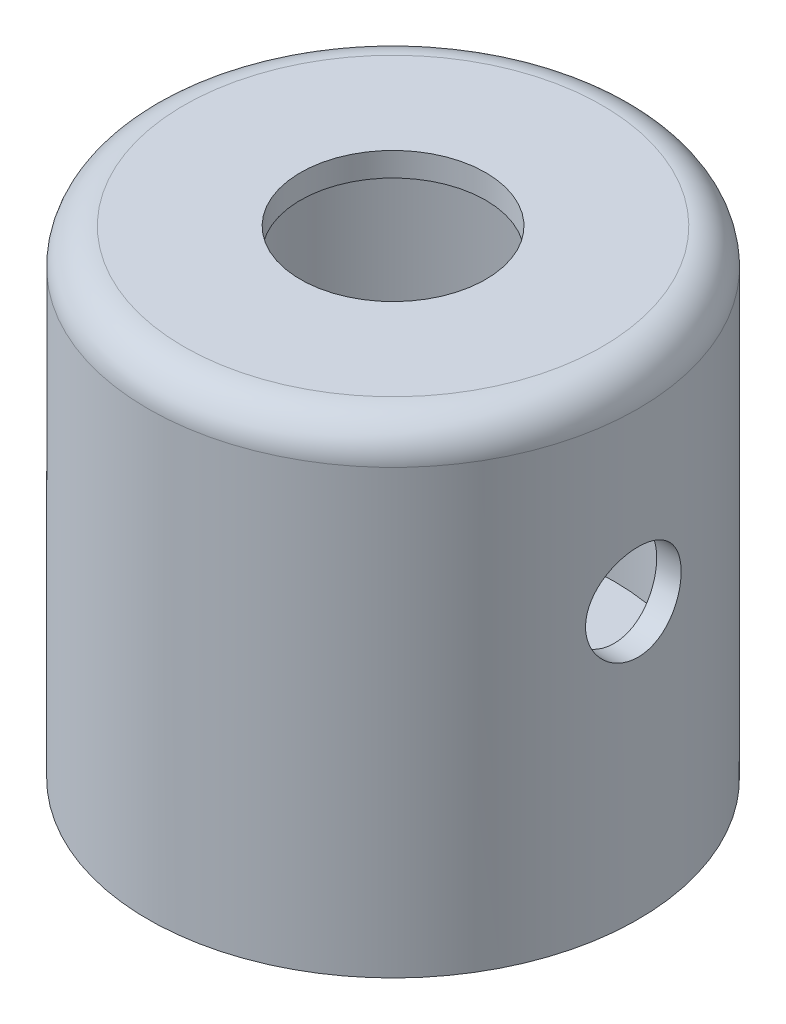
ISO-10303-21;
HEADER;
FILE_DESCRIPTION(('STEP AP214'),'2;1');
FILE_NAME('part.step','',(''),(''),'','','');
FILE_SCHEMA(('AUTOMOTIVE_DESIGN { 1 0 10303 214 1 1 1 1 }'));
ENDSEC;
DATA;
#1=APPLICATION_CONTEXT('core data for automotive mechanical design processes');
#2=APPLICATION_PROTOCOL_DEFINITION('international standard','automotive_design',2000,#1);
#3=PRODUCT_CONTEXT('',#1,'mechanical');
#4=PRODUCT('Part','Part','',(#3));
#5=PRODUCT_RELATED_PRODUCT_CATEGORY('part','',(#4));
#6=PRODUCT_DEFINITION_FORMATION('','',#4);
#7=PRODUCT_DEFINITION_CONTEXT('part definition',#1,'design');
#8=PRODUCT_DEFINITION('design','',#6,#7);
#9=PRODUCT_DEFINITION_SHAPE('','',#8);
#10=(LENGTH_UNIT() NAMED_UNIT(*) SI_UNIT(.MILLI.,.METRE.));
#11=(NAMED_UNIT(*) PLANE_ANGLE_UNIT() SI_UNIT($,.RADIAN.));
#12=(NAMED_UNIT(*) SI_UNIT($,.STERADIAN.) SOLID_ANGLE_UNIT());
#13=UNCERTAINTY_MEASURE_WITH_UNIT(LENGTH_MEASURE(1.E-05),#10,'distance_accuracy_value','');
#14=(GEOMETRIC_REPRESENTATION_CONTEXT(3) GLOBAL_UNCERTAINTY_ASSIGNED_CONTEXT((#13)) GLOBAL_UNIT_ASSIGNED_CONTEXT((#10,
#11,#12)) REPRESENTATION_CONTEXT('',''));
#15=CARTESIAN_POINT('',(0.,0.,0.));
#16=DIRECTION('',(0.,0.,1.));
#17=DIRECTION('',(1.,0.,0.));
#18=AXIS2_PLACEMENT_3D('',#15,#16,#17);
#19=CARTESIAN_POINT('',(0.,-16.6647208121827,0.));
#20=DIRECTION('',(0.,-1.,0.));
#21=DIRECTION('',(0.,0.,-1.));
#22=AXIS2_PLACEMENT_3D('',#19,#20,#21);
#23=CYLINDRICAL_SURFACE('',#22,20.5);
#24=CARTESIAN_POINT('',(0.,0.,0.));
#25=DIRECTION('',(0.,-1.,0.));
#26=DIRECTION('',(0.,0.,-1.));
#27=AXIS2_PLACEMENT_3D('',#24,#25,#26);
#28=CIRCLE('',#27,20.5);
#29=CARTESIAN_POINT('',(0.,0.,-20.5));
#30=VERTEX_POINT('',#29);
#31=EDGE_CURVE('E51',#30,#30,#28,.T.);
#32=ORIENTED_EDGE('',*,*,#31,.F.);
#33=EDGE_LOOP('',(#32));
#34=FACE_BOUND('',#33,.T.);
#35=CARTESIAN_POINT('',(0.,37.,0.));
#36=DIRECTION('',(0.,1.,0.));
#37=DIRECTION('',(0.,0.,1.));
#38=AXIS2_PLACEMENT_3D('',#35,#36,#37);
#39=CIRCLE('',#38,20.5);
#40=CARTESIAN_POINT('',(0.,37.,20.5));
#41=VERTEX_POINT('',#40);
#42=EDGE_CURVE('E48',#41,#41,#39,.F.);
#43=ORIENTED_EDGE('',*,*,#42,.T.);
#44=EDGE_LOOP('',(#43));
#45=FACE_BOUND('',#44,.T.);
#46=CARTESIAN_POINT('',(20.1059692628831,23.,4.));
#47=CARTESIAN_POINT('',(20.1059736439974,23.222374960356,3.9999916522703));
#48=CARTESIAN_POINT('',(20.1096986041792,23.4448563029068,3.9813930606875));
#49=CARTESIAN_POINT('',(20.1241754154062,23.8835332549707,3.90754738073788));
#50=CARTESIAN_POINT('',(20.1349330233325,24.0997235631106,3.85227026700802));
#51=CARTESIAN_POINT('',(20.1622114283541,24.519408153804,3.70684007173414));
#52=CARTESIAN_POINT('',(20.1787266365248,24.7229145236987,3.61672080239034));
#53=CARTESIAN_POINT('',(20.2156527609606,25.1119110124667,3.40425584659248));
#54=CARTESIAN_POINT('',(20.2360634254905,25.2974022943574,3.28191224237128));
#55=CARTESIAN_POINT('',(20.2787877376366,25.6476123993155,3.00671532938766));
#56=CARTESIAN_POINT('',(20.301121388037,25.8120533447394,2.85351144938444));
#57=CARTESIAN_POINT('',(20.3449989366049,26.1130709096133,2.52170041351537));
#58=CARTESIAN_POINT('',(20.3665427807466,26.249645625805,2.34309152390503));
#59=CARTESIAN_POINT('',(20.4066284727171,26.4921268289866,1.96370629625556));
#60=CARTESIAN_POINT('',(20.4251439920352,26.597770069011,1.76275868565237));
#61=CARTESIAN_POINT('',(20.4568624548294,26.7736918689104,1.34554453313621));
#62=CARTESIAN_POINT('',(20.4700658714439,26.8439735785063,1.12927935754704));
#63=CARTESIAN_POINT('',(20.4895311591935,26.946314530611,0.69045119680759));
#64=CARTESIAN_POINT('',(20.4958781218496,26.9788426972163,0.468001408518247));
#65=CARTESIAN_POINT('',(20.5012090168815,27.0062154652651,0.0207174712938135));
#66=CARTESIAN_POINT('',(20.5001936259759,27.0010635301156,-0.204116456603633));
#67=CARTESIAN_POINT('',(20.4909803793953,26.9535795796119,-0.646566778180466));
#68=CARTESIAN_POINT('',(20.4828800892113,26.9117525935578,-0.864239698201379));
#69=CARTESIAN_POINT('',(20.4605169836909,26.7929059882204,-1.28941675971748));
#70=CARTESIAN_POINT('',(20.4462539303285,26.7158850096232,-1.49692050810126));
#71=CARTESIAN_POINT('',(20.4130061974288,26.5283636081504,-1.89731928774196));
#72=CARTESIAN_POINT('',(20.3939935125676,26.4176637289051,-2.09011848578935));
#73=CARTESIAN_POINT('',(20.3533451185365,26.1660742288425,-2.4545921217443));
#74=CARTESIAN_POINT('',(20.3317091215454,26.0251812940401,-2.6262642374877));
#75=CARTESIAN_POINT('',(20.2877828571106,25.7144295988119,-2.94660576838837));
#76=CARTESIAN_POINT('',(20.2654876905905,25.5441289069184,-3.09484612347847));
#77=CARTESIAN_POINT('',(20.2230975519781,25.1808615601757,-3.36073015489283));
#78=CARTESIAN_POINT('',(20.2030026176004,24.9878945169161,-3.47837330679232));
#79=CARTESIAN_POINT('',(20.1672795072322,24.5841747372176,-3.67986121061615));
#80=CARTESIAN_POINT('',(20.1516601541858,24.3733879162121,-3.76363933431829));
#81=CARTESIAN_POINT('',(20.1267882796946,23.9403554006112,-3.89446695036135));
#82=CARTESIAN_POINT('',(20.1175349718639,23.7181111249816,-3.94152097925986));
#83=CARTESIAN_POINT('',(20.1065996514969,23.27235331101,-3.99692935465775));
#84=CARTESIAN_POINT('',(20.1047966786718,23.0489195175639,-4.00590203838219));
#85=CARTESIAN_POINT('',(20.1086418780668,22.6037472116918,-3.9865543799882));
#86=CARTESIAN_POINT('',(20.1142896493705,22.3820086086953,-3.95823604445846));
#87=CARTESIAN_POINT('',(20.1322869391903,21.9485812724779,-3.86564238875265));
#88=CARTESIAN_POINT('',(20.144575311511,21.7368197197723,-3.80169497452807));
#89=CARTESIAN_POINT('',(20.1744159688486,21.3270164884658,-3.64000793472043));
#90=CARTESIAN_POINT('',(20.1919686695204,21.1289758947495,-3.54226564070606));
#91=CARTESIAN_POINT('',(20.2306334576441,20.7495232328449,-3.31435437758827));
#92=CARTESIAN_POINT('',(20.2517871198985,20.5683487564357,-3.18379702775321));
#93=CARTESIAN_POINT('',(20.2951551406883,20.2302546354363,-2.89448178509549));
#94=CARTESIAN_POINT('',(20.3173696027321,20.0733373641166,-2.73572113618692));
#95=CARTESIAN_POINT('',(20.3607472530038,19.7858812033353,-2.39173570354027));
#96=CARTESIAN_POINT('',(20.3818904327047,19.6557595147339,-2.2061593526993));
#97=CARTESIAN_POINT('',(20.4203998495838,19.4285415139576,-1.81542090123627));
#98=CARTESIAN_POINT('',(20.4377662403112,19.3314438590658,-1.61025959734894));
#99=CARTESIAN_POINT('',(20.4666796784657,19.1736448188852,-1.18729396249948));
#100=CARTESIAN_POINT('',(20.4782585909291,19.11274378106,-0.969566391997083));
#101=CARTESIAN_POINT('',(20.4944288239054,19.0284322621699,-0.526724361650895));
#102=CARTESIAN_POINT('',(20.4990209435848,19.0050174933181,-0.301610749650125));
#103=CARTESIAN_POINT('',(20.5006824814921,18.9965025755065,0.14562193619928));
#104=CARTESIAN_POINT('',(20.4978752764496,19.0107740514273,0.367728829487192));
#105=CARTESIAN_POINT('',(20.4853117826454,19.0758435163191,0.80631481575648));
#106=CARTESIAN_POINT('',(20.4755555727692,19.1266410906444,1.02279397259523));
#107=CARTESIAN_POINT('',(20.4501923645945,19.2630471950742,1.44361146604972));
#108=CARTESIAN_POINT('',(20.4345974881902,19.3485836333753,1.64797394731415));
#109=CARTESIAN_POINT('',(20.3992396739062,19.5519616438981,2.03953776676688));
#110=CARTESIAN_POINT('',(20.3794764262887,19.669805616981,2.22673782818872));
#111=CARTESIAN_POINT('',(20.3375736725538,19.9365904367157,2.5817796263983));
#112=CARTESIAN_POINT('',(20.3154022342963,20.0859826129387,2.74927849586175));
#113=CARTESIAN_POINT('',(20.2713762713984,20.4106920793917,3.05704655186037));
#114=CARTESIAN_POINT('',(20.2495218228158,20.5860154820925,3.19730930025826));
#115=CARTESIAN_POINT('',(20.208360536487,20.959745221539,3.44797155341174));
#116=CARTESIAN_POINT('',(20.1890818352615,21.1583679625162,3.55805320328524));
#117=CARTESIAN_POINT('',(20.1555964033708,21.5716071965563,3.74310681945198));
#118=CARTESIAN_POINT('',(20.1413850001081,21.7862087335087,3.8181111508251));
#119=CARTESIAN_POINT('',(20.1225305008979,22.1677965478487,3.91605787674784));
#120=CARTESIAN_POINT('',(20.1163578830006,22.3325828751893,3.94748080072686));
#121=CARTESIAN_POINT('',(20.1080756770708,22.6648927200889,3.98945467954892));
#122=CARTESIAN_POINT('',(20.1059659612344,22.8324161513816,4.00000629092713));
#123=CARTESIAN_POINT('',(20.1059692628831,23.,4.));
#124=B_SPLINE_CURVE_WITH_KNOTS('',3,(#46,#47,#48,#49,#50,#51,#52,#53,#54,#55,#56,#57,#58,#59,
#60,#61,#62,#63,#64,#65,#66,#67,#68,#69,#70,#71,#72,#73,#74,#75,#76,#77,#78,#79,#80,#81,#82,#83,
#84,#85,#86,#87,#88,#89,#90,#91,#92,#93,#94,#95,#96,#97,#98,#99,#100,#101,#102,#103,#104,#105,
#106,#107,#108,#109,#110,#111,#112,#113,#114,#115,#116,#117,#118,#119,#120,#121,#122,#123),
.UNSPECIFIED.,.T.,.F.,(4,2,2,2,2,2,2,2,2,2,2,2,2,2,2,2,2,2,2,2,2,2,2,2,2,2,2,2,2,2,2,2,2,2,2,2,
2,2,4),(0.,0.666511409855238,1.3335691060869,1.99998108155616,2.66635000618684,3.34076545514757,
4.0152269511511,4.69527197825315,5.37525642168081,6.04670143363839,6.71808472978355,
7.38036550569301,8.04267186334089,8.70897957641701,9.37536046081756,10.0528011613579,
10.7302534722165,11.4090322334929,12.087727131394,12.7553586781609,13.4229543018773,
14.0845049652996,14.7461078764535,15.4159437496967,16.0858451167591,16.7654973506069,
17.4451219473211,18.1209622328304,18.7967252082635,19.4612920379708,20.1258513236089,
20.7890384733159,21.4522749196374,22.1257345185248,22.7993531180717,23.4798149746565,
24.1596477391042,24.6619527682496,25.1642419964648),.UNSPECIFIED.);
#125=CARTESIAN_POINT('',(20.1059692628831,23.,4.));
#126=VERTEX_POINT('',#125);
#127=EDGE_CURVE('E75',#126,#126,#124,.T.);
#128=ORIENTED_EDGE('',*,*,#127,.T.);
#129=EDGE_LOOP('',(#128));
#130=FACE_BOUND('',#129,.T.);
#131=ADVANCED_FACE('F27',(#34,#45,#130),#23,.T.);
#132=CARTESIAN_POINT('',(0.,-16.6647208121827,0.));
#133=DIRECTION('',(0.,-1.,0.));
#134=DIRECTION('',(0.,0.,-1.));
#135=AXIS2_PLACEMENT_3D('',#132,#133,#134);
#136=CYLINDRICAL_SURFACE('',#135,18.5);
#137=CARTESIAN_POINT('',(0.,5.,0.));
#138=DIRECTION('',(0.,-1.,0.));
#139=DIRECTION('',(0.,0.,-1.));
#140=AXIS2_PLACEMENT_3D('',#137,#138,#139);
#141=CIRCLE('',#140,18.5);
#142=CARTESIAN_POINT('',(0.,5.,-18.5));
#143=VERTEX_POINT('',#142);
#144=EDGE_CURVE('E60',#143,#143,#141,.T.);
#145=ORIENTED_EDGE('',*,*,#144,.T.);
#146=EDGE_LOOP('',(#145));
#147=FACE_BOUND('',#146,.T.);
#148=CARTESIAN_POINT('',(0.,37.,0.));
#149=DIRECTION('',(0.,-1.,0.));
#150=DIRECTION('',(0.,0.,-1.));
#151=AXIS2_PLACEMENT_3D('',#148,#149,#150);
#152=CIRCLE('',#151,18.5);
#153=CARTESIAN_POINT('',(0.,37.,-18.5));
#154=VERTEX_POINT('',#153);
#155=EDGE_CURVE('E10',#154,#154,#152,.F.);
#156=ORIENTED_EDGE('',*,*,#155,.T.);
#157=EDGE_LOOP('',(#156));
#158=FACE_BOUND('',#157,.T.);
#159=CARTESIAN_POINT('',(18.0623918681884,23.,4.));
#160=CARTESIAN_POINT('',(18.0623963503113,22.7781543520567,3.99999228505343));
#161=CARTESIAN_POINT('',(18.0665234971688,22.5562153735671,3.98148143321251));
#162=CARTESIAN_POINT('',(18.0825566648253,22.1186443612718,3.90800545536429));
#163=CARTESIAN_POINT('',(18.09446839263,21.9030170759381,3.85301358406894));
#164=CARTESIAN_POINT('',(18.1246600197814,21.4844625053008,3.70838424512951));
#165=CARTESIAN_POINT('',(18.1429330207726,21.2815217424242,3.61878429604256));
#166=CARTESIAN_POINT('',(18.1837799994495,20.8935496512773,3.40758896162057));
#167=CARTESIAN_POINT('',(18.2063538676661,20.708517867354,3.28599439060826));
#168=CARTESIAN_POINT('',(18.2536754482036,20.358557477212,3.01212159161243));
#169=CARTESIAN_POINT('',(18.2784504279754,20.1939675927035,2.85941517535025));
#170=CARTESIAN_POINT('',(18.3271438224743,19.8925283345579,2.5285779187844));
#171=CARTESIAN_POINT('',(18.3510621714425,19.7556810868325,2.35044513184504));
#172=CARTESIAN_POINT('',(18.3956439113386,19.5122753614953,1.9715445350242));
#173=CARTESIAN_POINT('',(18.4162713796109,19.4060421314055,1.7705631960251));
#174=CARTESIAN_POINT('',(18.4516394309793,19.2289834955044,1.35308090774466));
#175=CARTESIAN_POINT('',(18.4663806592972,19.1581542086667,1.13658166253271));
#176=CARTESIAN_POINT('',(18.488122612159,19.0549778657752,0.697730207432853));
#177=CARTESIAN_POINT('',(18.4952384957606,19.0220577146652,0.475518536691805));
#178=CARTESIAN_POINT('',(18.5013268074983,18.9938428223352,0.0286201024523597));
#179=CARTESIAN_POINT('',(18.5003001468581,18.9985438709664,-0.196066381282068));
#180=CARTESIAN_POINT('',(18.4903072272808,19.045010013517,-0.637587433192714));
#181=CARTESIAN_POINT('',(18.4814732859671,19.0861574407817,-0.854490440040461));
#182=CARTESIAN_POINT('',(18.4570089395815,19.2033646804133,-1.27823806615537));
#183=CARTESIAN_POINT('',(18.4413782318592,19.2794260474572,-1.48508223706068));
#184=CARTESIAN_POINT('',(18.4048631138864,19.4648519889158,-1.88456186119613));
#185=CARTESIAN_POINT('',(18.3839417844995,19.5744517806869,-2.07708462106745));
#186=CARTESIAN_POINT('',(18.3391411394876,19.8236682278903,-2.4412315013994));
#187=CARTESIAN_POINT('',(18.3152614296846,19.9632888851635,-2.6128528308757));
#188=CARTESIAN_POINT('',(18.2665983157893,20.2719500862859,-2.93399763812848));
#189=CARTESIAN_POINT('',(18.2418064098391,20.4415312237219,-3.08300069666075));
#190=CARTESIAN_POINT('',(18.1945688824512,20.8035298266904,-3.35054852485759));
#191=CARTESIAN_POINT('',(18.1721233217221,20.995947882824,-3.46909250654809));
#192=CARTESIAN_POINT('',(18.1320981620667,21.3989865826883,-3.6725811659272));
#193=CARTESIAN_POINT('',(18.114532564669,21.6096573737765,-3.75742945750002));
#194=CARTESIAN_POINT('',(18.0864516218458,22.0427361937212,-3.89036395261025));
#195=CARTESIAN_POINT('',(18.0759351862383,22.2651424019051,-3.9384558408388));
#196=CARTESIAN_POINT('',(18.0633650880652,22.7106288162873,-3.99570924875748));
#197=CARTESIAN_POINT('',(18.0611469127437,22.9336072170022,-4.00562767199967));
#198=CARTESIAN_POINT('',(18.0649810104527,23.378031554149,-3.98830010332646));
#199=CARTESIAN_POINT('',(18.0710327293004,23.5994775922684,-3.96105660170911));
#200=CARTESIAN_POINT('',(18.0905695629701,24.031928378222,-3.8708346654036));
#201=CARTESIAN_POINT('',(18.1039682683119,24.2430240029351,-3.80827138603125));
#202=CARTESIAN_POINT('',(18.1366117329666,24.6517365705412,-3.64963456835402));
#203=CARTESIAN_POINT('',(18.1558570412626,24.8493522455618,-3.55355788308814));
#204=CARTESIAN_POINT('',(18.1983878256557,25.2287759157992,-3.32894759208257));
#205=CARTESIAN_POINT('',(18.2217298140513,25.4103008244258,-3.19994669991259));
#206=CARTESIAN_POINT('',(18.2696740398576,25.7494041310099,-2.91376287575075));
#207=CARTESIAN_POINT('',(18.2942764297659,25.9069796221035,-2.75657652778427));
#208=CARTESIAN_POINT('',(18.3425105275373,26.1966395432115,-2.41506237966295));
#209=CARTESIAN_POINT('',(18.3661164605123,26.3282085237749,-2.23029314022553));
#210=CARTESIAN_POINT('',(18.4092273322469,26.5584387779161,-1.84083556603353));
#211=CARTESIAN_POINT('',(18.4287324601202,26.6571015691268,-1.63614815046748));
#212=CARTESIAN_POINT('',(18.4613351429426,26.8179962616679,-1.21392458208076));
#213=CARTESIAN_POINT('',(18.4744726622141,26.8804558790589,-0.996478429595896));
#214=CARTESIAN_POINT('',(18.4930324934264,26.9678839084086,-0.553864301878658));
#215=CARTESIAN_POINT('',(18.49845589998,26.9928576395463,-0.328697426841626));
#216=CARTESIAN_POINT('',(18.5009448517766,27.0043704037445,0.118069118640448));
#217=CARTESIAN_POINT('',(18.4981779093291,26.991679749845,0.339648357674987));
#218=CARTESIAN_POINT('',(18.4849550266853,26.9299439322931,0.777436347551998));
#219=CARTESIAN_POINT('',(18.4744992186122,26.8808993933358,0.993645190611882));
#220=CARTESIAN_POINT('',(18.4470847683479,26.7482135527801,1.41397522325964));
#221=CARTESIAN_POINT('',(18.4301462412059,26.6646792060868,1.61813157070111));
#222=CARTESIAN_POINT('',(18.3915771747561,26.4654901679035,2.00963422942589));
#223=CARTESIAN_POINT('',(18.3699461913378,26.3498324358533,2.19697894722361));
#224=CARTESIAN_POINT('',(18.323851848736,26.0871558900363,2.55330503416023));
#225=CARTESIAN_POINT('',(18.2993433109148,25.9395940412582,2.72188028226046));
#226=CARTESIAN_POINT('',(18.2505028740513,25.6183962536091,3.03213952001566));
#227=CARTESIAN_POINT('',(18.2261710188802,25.4447540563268,3.17381703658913));
#228=CARTESIAN_POINT('',(18.1800869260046,25.0736109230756,3.42803016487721));
#229=CARTESIAN_POINT('',(18.1583723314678,24.87582919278,3.54016302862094));
#230=CARTESIAN_POINT('',(18.1204526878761,24.4638032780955,3.72942121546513));
#231=CARTESIAN_POINT('',(18.1042429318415,24.2495733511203,3.80657646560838));
#232=CARTESIAN_POINT('',(18.0821987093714,23.8625720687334,3.90974834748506));
#233=CARTESIAN_POINT('',(18.0748199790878,23.6919158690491,3.94352842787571));
#234=CARTESIAN_POINT('',(18.0649149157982,23.3475254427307,3.98865675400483));
#235=CARTESIAN_POINT('',(18.0623883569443,23.1737913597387,4.00000604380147));
#236=CARTESIAN_POINT('',(18.0623918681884,23.,4.));
#237=B_SPLINE_CURVE_WITH_KNOTS('',3,(#159,#160,#161,#162,#163,#164,#165,#166,#167,#168,#169,
#170,#171,#172,#173,#174,#175,#176,#177,#178,#179,#180,#181,#182,#183,#184,#185,#186,#187,#188,
#189,#190,#191,#192,#193,#194,#195,#196,#197,#198,#199,#200,#201,#202,#203,#204,#205,#206,#207,
#208,#209,#210,#211,#212,#213,#214,#215,#216,#217,#218,#219,#220,#221,#222,#223,#224,#225,#226,
#227,#228,#229,#230,#231,#232,#233,#234,#235,#236),.UNSPECIFIED.,.T.,.F.,(4,2,2,2,2,2,2,2,2,2,2,
2,2,2,2,2,2,2,2,2,2,2,2,2,2,2,2,2,2,2,2,2,2,2,2,2,2,2,4),(0.,0.664900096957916,1.33028819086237,
1.9949569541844,2.65960880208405,3.33411478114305,4.00867242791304,4.6901526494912,
5.37155814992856,6.0425213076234,6.71340937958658,7.37314073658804,8.03290147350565,
8.69739973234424,9.36198662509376,10.0400899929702,10.7182109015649,11.3982578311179,
12.0781995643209,12.7445877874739,13.4109313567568,14.0696009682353,14.7283324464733,
15.3969905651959,16.0657297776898,16.7466254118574,17.4274896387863,18.1040234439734,
18.7804612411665,19.4431604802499,20.1058483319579,20.7664964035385,21.4272070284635,
22.1002003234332,22.7733553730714,23.4552606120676,24.1365813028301,24.6574807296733,
25.1783559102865),.UNSPECIFIED.);
#238=CARTESIAN_POINT('',(18.0623918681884,23.,4.));
#239=VERTEX_POINT('',#238);
#240=EDGE_CURVE('E31',#239,#239,#237,.T.);
#241=ORIENTED_EDGE('',*,*,#240,.T.);
#242=EDGE_LOOP('',(#241));
#243=FACE_BOUND('',#242,.T.);
#244=ADVANCED_FACE('F111',(#147,#158,#243),#136,.F.);
#245=CARTESIAN_POINT('',(18.5,0.,0.));
#246=DIRECTION('',(0.,-1.,0.));
#247=DIRECTION('',(0.,0.,-1.));
#248=AXIS2_PLACEMENT_3D('',#245,#246,#247);
#249=PLANE('',#248);
#250=ORIENTED_EDGE('',*,*,#31,.T.);
#251=EDGE_LOOP('',(#250));
#252=FACE_BOUND('',#251,.T.);
#253=CARTESIAN_POINT('',(0.,0.,0.));
#254=DIRECTION('',(0.,-1.,0.));
#255=DIRECTION('',(0.,0.,-1.));
#256=AXIS2_PLACEMENT_3D('',#253,#254,#255);
#257=CIRCLE('',#256,18.5);
#258=CARTESIAN_POINT('',(0.,0.,-18.5));
#259=VERTEX_POINT('',#258);
#260=EDGE_CURVE('E72',#259,#259,#257,.T.);
#261=ORIENTED_EDGE('',*,*,#260,.F.);
#262=EDGE_LOOP('',(#261));
#263=FACE_BOUND('',#262,.T.);
#264=ADVANCED_FACE('F29',(#252,#263),#249,.T.);
#265=CARTESIAN_POINT('',(7.75000000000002,40.,0.));
#266=DIRECTION('',(0.,1.,0.));
#267=DIRECTION('',(0.,0.,1.));
#268=AXIS2_PLACEMENT_3D('',#265,#266,#267);
#269=PLANE('',#268);
#270=CARTESIAN_POINT('',(0.,40.,0.));
#271=DIRECTION('',(0.,1.,0.));
#272=DIRECTION('',(0.,0.,1.));
#273=AXIS2_PLACEMENT_3D('',#270,#271,#272);
#274=CIRCLE('',#273,17.5);
#275=CARTESIAN_POINT('',(0.,40.,17.5));
#276=VERTEX_POINT('',#275);
#277=EDGE_CURVE('E43',#276,#276,#274,.T.);
#278=ORIENTED_EDGE('',*,*,#277,.T.);
#279=EDGE_LOOP('',(#278));
#280=FACE_BOUND('',#279,.T.);
#281=CARTESIAN_POINT('',(0.,40.,0.));
#282=DIRECTION('',(0.,-1.,0.));
#283=DIRECTION('',(0.,0.,-1.));
#284=AXIS2_PLACEMENT_3D('',#281,#282,#283);
#285=CIRCLE('',#284,7.75000000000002);
#286=CARTESIAN_POINT('',(0.,40.,-7.75000000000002));
#287=VERTEX_POINT('',#286);
#288=EDGE_CURVE('E54',#287,#287,#285,.T.);
#289=ORIENTED_EDGE('',*,*,#288,.T.);
#290=EDGE_LOOP('',(#289));
#291=FACE_BOUND('',#290,.T.);
#292=ADVANCED_FACE('F121',(#280,#291),#269,.T.);
#293=CARTESIAN_POINT('',(0.,-16.6647208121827,0.));
#294=DIRECTION('',(0.,-1.,0.));
#295=DIRECTION('',(0.,0.,-1.));
#296=AXIS2_PLACEMENT_3D('',#293,#294,#295);
#297=CYLINDRICAL_SURFACE('',#296,7.75000000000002);
#298=CARTESIAN_POINT('',(0.,38.,0.));
#299=DIRECTION('',(0.,-1.,0.));
#300=DIRECTION('',(0.,0.,-1.));
#301=AXIS2_PLACEMENT_3D('',#298,#299,#300);
#302=CIRCLE('',#301,7.75000000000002);
#303=CARTESIAN_POINT('',(0.,38.,-7.75000000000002));
#304=VERTEX_POINT('',#303);
#305=EDGE_CURVE('E57',#304,#304,#302,.T.);
#306=ORIENTED_EDGE('',*,*,#305,.T.);
#307=EDGE_LOOP('',(#306));
#308=FACE_BOUND('',#307,.T.);
#309=ORIENTED_EDGE('',*,*,#288,.F.);
#310=EDGE_LOOP('',(#309));
#311=FACE_BOUND('',#310,.T.);
#312=ADVANCED_FACE('F118',(#308,#311),#297,.F.);
#313=CARTESIAN_POINT('',(7.75000000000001,38.,0.));
#314=DIRECTION('',(0.,-1.,0.));
#315=DIRECTION('',(0.,0.,-1.));
#316=AXIS2_PLACEMENT_3D('',#313,#314,#315);
#317=PLANE('',#316);
#318=CARTESIAN_POINT('',(0.,38.,0.));
#319=DIRECTION('',(0.,-1.,0.));
#320=DIRECTION('',(0.,0.,-1.));
#321=AXIS2_PLACEMENT_3D('',#318,#319,#320);
#322=CIRCLE('',#321,17.5);
#323=CARTESIAN_POINT('',(0.,38.,-17.5));
#324=VERTEX_POINT('',#323);
#325=EDGE_CURVE('E39',#324,#324,#322,.T.);
#326=ORIENTED_EDGE('',*,*,#325,.T.);
#327=EDGE_LOOP('',(#326));
#328=FACE_BOUND('',#327,.T.);
#329=ORIENTED_EDGE('',*,*,#305,.F.);
#330=EDGE_LOOP('',(#329));
#331=FACE_BOUND('',#330,.T.);
#332=ADVANCED_FACE('F109',(#328,#331),#317,.T.);
#333=CARTESIAN_POINT('',(7.75,5.,0.));
#334=DIRECTION('',(0.,1.,0.));
#335=DIRECTION('',(0.,0.,1.));
#336=AXIS2_PLACEMENT_3D('',#333,#334,#335);
#337=PLANE('',#336);
#338=CARTESIAN_POINT('',(0.,5.,0.));
#339=DIRECTION('',(0.,-1.,0.));
#340=DIRECTION('',(0.,0.,-1.));
#341=AXIS2_PLACEMENT_3D('',#338,#339,#340);
#342=CIRCLE('',#341,7.75);
#343=CARTESIAN_POINT('',(0.,5.,-7.75));
#344=VERTEX_POINT('',#343);
#345=EDGE_CURVE('E63',#344,#344,#342,.T.);
#346=ORIENTED_EDGE('',*,*,#345,.T.);
#347=EDGE_LOOP('',(#346));
#348=FACE_BOUND('',#347,.T.);
#349=ORIENTED_EDGE('',*,*,#144,.F.);
#350=EDGE_LOOP('',(#349));
#351=FACE_BOUND('',#350,.T.);
#352=ADVANCED_FACE('F106',(#348,#351),#337,.T.);
#353=CARTESIAN_POINT('',(0.,-16.6647208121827,0.));
#354=DIRECTION('',(0.,-1.,0.));
#355=DIRECTION('',(0.,0.,-1.));
#356=AXIS2_PLACEMENT_3D('',#353,#354,#355);
#357=CYLINDRICAL_SURFACE('',#356,7.75);
#358=CARTESIAN_POINT('',(0.,3.,0.));
#359=DIRECTION('',(0.,-1.,0.));
#360=DIRECTION('',(0.,0.,-1.));
#361=AXIS2_PLACEMENT_3D('',#358,#359,#360);
#362=CIRCLE('',#361,7.75);
#363=CARTESIAN_POINT('',(0.,3.,-7.75));
#364=VERTEX_POINT('',#363);
#365=EDGE_CURVE('E66',#364,#364,#362,.T.);
#366=ORIENTED_EDGE('',*,*,#365,.T.);
#367=EDGE_LOOP('',(#366));
#368=FACE_BOUND('',#367,.T.);
#369=ORIENTED_EDGE('',*,*,#345,.F.);
#370=EDGE_LOOP('',(#369));
#371=FACE_BOUND('',#370,.T.);
#372=ADVANCED_FACE('F102',(#368,#371),#357,.F.);
#373=CARTESIAN_POINT('',(18.5,3.,0.));
#374=DIRECTION('',(0.,-1.,0.));
#375=DIRECTION('',(0.,0.,-1.));
#376=AXIS2_PLACEMENT_3D('',#373,#374,#375);
#377=PLANE('',#376);
#378=CARTESIAN_POINT('',(0.,3.,0.));
#379=DIRECTION('',(0.,-1.,0.));
#380=DIRECTION('',(0.,0.,-1.));
#381=AXIS2_PLACEMENT_3D('',#378,#379,#380);
#382=CIRCLE('',#381,18.5);
#383=CARTESIAN_POINT('',(0.,3.,-18.5));
#384=VERTEX_POINT('',#383);
#385=EDGE_CURVE('E69',#384,#384,#382,.T.);
#386=ORIENTED_EDGE('',*,*,#385,.T.);
#387=EDGE_LOOP('',(#386));
#388=FACE_BOUND('',#387,.T.);
#389=ORIENTED_EDGE('',*,*,#365,.F.);
#390=EDGE_LOOP('',(#389));
#391=FACE_BOUND('',#390,.T.);
#392=ADVANCED_FACE('F98',(#388,#391),#377,.T.);
#393=CARTESIAN_POINT('',(0.,-16.6647208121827,0.));
#394=DIRECTION('',(0.,-1.,0.));
#395=DIRECTION('',(0.,0.,-1.));
#396=AXIS2_PLACEMENT_3D('',#393,#394,#395);
#397=CYLINDRICAL_SURFACE('',#396,18.5);
#398=ORIENTED_EDGE('',*,*,#260,.T.);
#399=EDGE_LOOP('',(#398));
#400=FACE_BOUND('',#399,.T.);
#401=ORIENTED_EDGE('',*,*,#385,.F.);
#402=EDGE_LOOP('',(#401));
#403=FACE_BOUND('',#402,.T.);
#404=ADVANCED_FACE('F94',(#400,#403),#397,.F.);
#405=CARTESIAN_POINT('',(0.,37.,0.));
#406=DIRECTION('',(0.,1.,0.));
#407=DIRECTION('',(0.,0.,1.));
#408=AXIS2_PLACEMENT_3D('',#405,#406,#407);
#409=TOROIDAL_SURFACE('',#408,17.5,3.);
#410=ORIENTED_EDGE('',*,*,#277,.F.);
#411=EDGE_LOOP('',(#410));
#412=FACE_BOUND('',#411,.T.);
#413=ORIENTED_EDGE('',*,*,#42,.F.);
#414=EDGE_LOOP('',(#413));
#415=FACE_BOUND('',#414,.T.);
#416=ADVANCED_FACE('F90',(#412,#415),#409,.T.);
#417=CARTESIAN_POINT('',(0.,37.,0.));
#418=DIRECTION('',(0.,-1.,0.));
#419=DIRECTION('',(0.,0.,-1.));
#420=AXIS2_PLACEMENT_3D('',#417,#418,#419);
#421=TOROIDAL_SURFACE('',#420,17.5,1.);
#422=ORIENTED_EDGE('',*,*,#155,.F.);
#423=EDGE_LOOP('',(#422));
#424=FACE_BOUND('',#423,.T.);
#425=ORIENTED_EDGE('',*,*,#325,.F.);
#426=EDGE_LOOP('',(#425));
#427=FACE_BOUND('',#426,.T.);
#428=ADVANCED_FACE('F85',(#424,#427),#421,.F.);
#429=CARTESIAN_POINT('',(16.0333159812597,23.,0.));
#430=DIRECTION('',(-1.,0.,0.));
#431=DIRECTION('',(0.,0.,1.));
#432=AXIS2_PLACEMENT_3D('',#429,#430,#431);
#433=CYLINDRICAL_SURFACE('',#432,4.);
#434=ORIENTED_EDGE('',*,*,#127,.F.);
#435=EDGE_LOOP('',(#434));
#436=FACE_BOUND('',#435,.T.);
#437=ORIENTED_EDGE('',*,*,#240,.F.);
#438=EDGE_LOOP('',(#437));
#439=FACE_BOUND('',#438,.T.);
#440=ADVANCED_FACE('F81',(#436,#439),#433,.F.);
#441=CLOSED_SHELL('',(#131,#244,#264,#292,#312,#332,#352,#372,#392,#404,#416,#428,#440));
#442=MANIFOLD_SOLID_BREP('B2',#441);
#443=ADVANCED_BREP_SHAPE_REPRESENTATION('',(#18,#442),#14);
#444=SHAPE_DEFINITION_REPRESENTATION(#9,#443);
ENDSEC;
END-ISO-10303-21;
